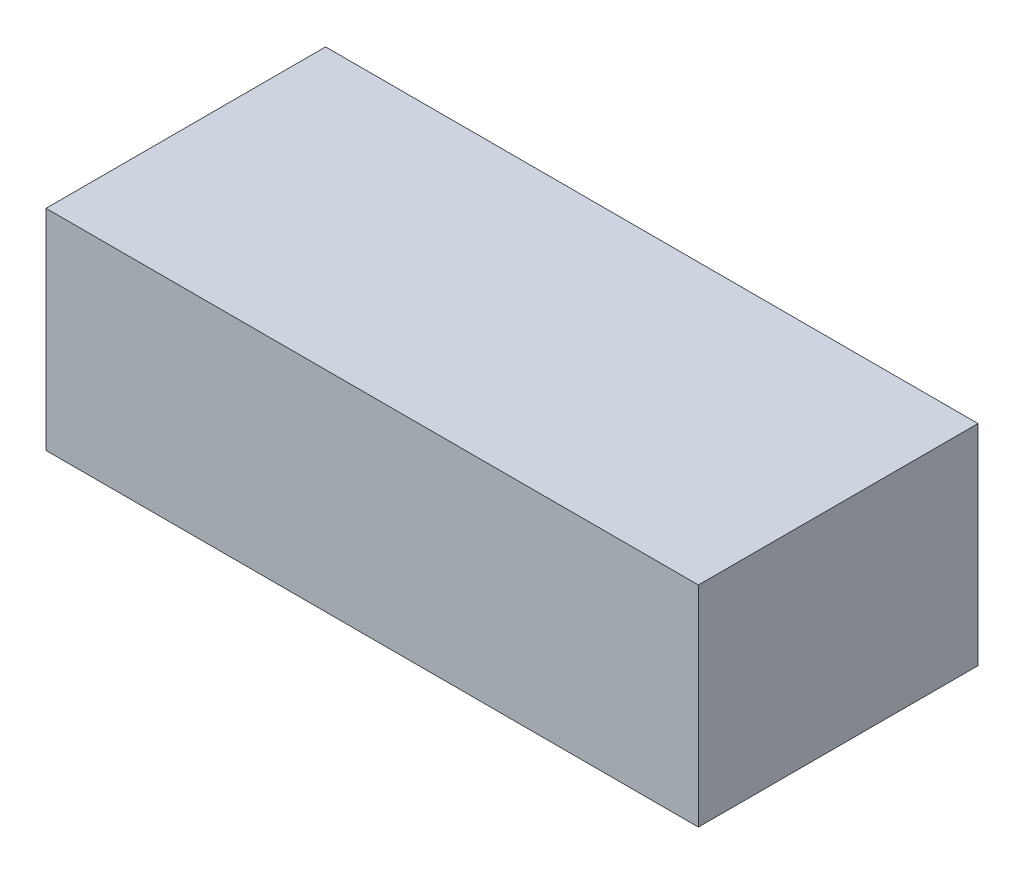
ISO-10303-21;
HEADER;
FILE_DESCRIPTION(('STEP AP214'),'2;1');
FILE_NAME('part.step','',(''),(''),'','','');
FILE_SCHEMA(('AUTOMOTIVE_DESIGN { 1 0 10303 214 1 1 1 1 }'));
ENDSEC;
DATA;
#1=APPLICATION_CONTEXT('core data for automotive mechanical design processes');
#2=APPLICATION_PROTOCOL_DEFINITION('international standard','automotive_design',2000,#1);
#3=PRODUCT_CONTEXT('',#1,'mechanical');
#4=PRODUCT('Part','Part','',(#3));
#5=PRODUCT_RELATED_PRODUCT_CATEGORY('part','',(#4));
#6=PRODUCT_DEFINITION_FORMATION('','',#4);
#7=PRODUCT_DEFINITION_CONTEXT('part definition',#1,'design');
#8=PRODUCT_DEFINITION('design','',#6,#7);
#9=PRODUCT_DEFINITION_SHAPE('','',#8);
#10=(LENGTH_UNIT() NAMED_UNIT(*) SI_UNIT(.MILLI.,.METRE.));
#11=(NAMED_UNIT(*) PLANE_ANGLE_UNIT() SI_UNIT($,.RADIAN.));
#12=(NAMED_UNIT(*) SI_UNIT($,.STERADIAN.) SOLID_ANGLE_UNIT());
#13=UNCERTAINTY_MEASURE_WITH_UNIT(LENGTH_MEASURE(1.E-05),#10,'distance_accuracy_value','');
#14=(GEOMETRIC_REPRESENTATION_CONTEXT(3) GLOBAL_UNCERTAINTY_ASSIGNED_CONTEXT((#13)) GLOBAL_UNIT_ASSIGNED_CONTEXT((#10,
#11,#12)) REPRESENTATION_CONTEXT('',''));
#15=CARTESIAN_POINT('',(0.,0.,0.));
#16=DIRECTION('',(0.,0.,1.));
#17=DIRECTION('',(1.,0.,0.));
#18=AXIS2_PLACEMENT_3D('',#15,#16,#17);
#19=CARTESIAN_POINT('',(-700.,-225.,-600.));
#20=DIRECTION('',(-1.,0.,0.));
#21=DIRECTION('',(0.,0.,1.));
#22=AXIS2_PLACEMENT_3D('',#19,#20,#21);
#23=PLANE('',#22);
#24=DIRECTION('',(0.,-1.,0.));
#25=VECTOR('',#24,1.);
#26=CARTESIAN_POINT('',(-700.,-225.,0.));
#27=LINE('',#26,#25);
#28=CARTESIAN_POINT('',(-700.,225.,0.));
#29=VERTEX_POINT('',#28);
#30=CARTESIAN_POINT('',(-700.,-225.,0.));
#31=VERTEX_POINT('',#30);
#32=EDGE_CURVE('E103',#29,#31,#27,.T.);
#33=ORIENTED_EDGE('',*,*,#32,.F.);
#34=DIRECTION('',(0.,0.,1.));
#35=VECTOR('',#34,1.);
#36=CARTESIAN_POINT('',(-700.,225.,-600.));
#37=LINE('',#36,#35);
#38=CARTESIAN_POINT('',(-700.,225.,-600.));
#39=VERTEX_POINT('',#38);
#40=EDGE_CURVE('E11',#39,#29,#37,.T.);
#41=ORIENTED_EDGE('',*,*,#40,.F.);
#42=DIRECTION('',(0.,-1.,0.));
#43=VECTOR('',#42,1.);
#44=CARTESIAN_POINT('',(-700.,-225.,-600.));
#45=LINE('',#44,#43);
#46=CARTESIAN_POINT('',(-700.,-225.,-600.));
#47=VERTEX_POINT('',#46);
#48=EDGE_CURVE('E100',#39,#47,#45,.T.);
#49=ORIENTED_EDGE('',*,*,#48,.T.);
#50=DIRECTION('',(0.,0.,1.));
#51=VECTOR('',#50,1.);
#52=CARTESIAN_POINT('',(-700.,-225.,-600.));
#53=LINE('',#52,#51);
#54=EDGE_CURVE('E45',#47,#31,#53,.T.);
#55=ORIENTED_EDGE('',*,*,#54,.T.);
#56=EDGE_LOOP('',(#33,#41,#49,#55));
#57=FACE_BOUND('',#56,.T.);
#58=ADVANCED_FACE('F39',(#57),#23,.T.);
#59=CARTESIAN_POINT('',(-700.,225.,-600.));
#60=DIRECTION('',(0.,1.,0.));
#61=DIRECTION('',(0.,0.,1.));
#62=AXIS2_PLACEMENT_3D('',#59,#60,#61);
#63=PLANE('',#62);
#64=DIRECTION('',(-1.,0.,0.));
#65=VECTOR('',#64,1.);
#66=CARTESIAN_POINT('',(-700.,225.,0.));
#67=LINE('',#66,#65);
#68=CARTESIAN_POINT('',(700.,225.,0.));
#69=VERTEX_POINT('',#68);
#70=EDGE_CURVE('E97',#69,#29,#67,.T.);
#71=ORIENTED_EDGE('',*,*,#70,.F.);
#72=DIRECTION('',(0.,0.,1.));
#73=VECTOR('',#72,1.);
#74=CARTESIAN_POINT('',(700.,225.,-600.));
#75=LINE('',#74,#73);
#76=CARTESIAN_POINT('',(700.,225.,-600.));
#77=VERTEX_POINT('',#76);
#78=EDGE_CURVE('E48',#77,#69,#75,.T.);
#79=ORIENTED_EDGE('',*,*,#78,.F.);
#80=DIRECTION('',(-1.,0.,0.));
#81=VECTOR('',#80,1.);
#82=CARTESIAN_POINT('',(-700.,225.,-600.));
#83=LINE('',#82,#81);
#84=EDGE_CURVE('E94',#77,#39,#83,.T.);
#85=ORIENTED_EDGE('',*,*,#84,.T.);
#86=ORIENTED_EDGE('',*,*,#40,.T.);
#87=EDGE_LOOP('',(#71,#79,#85,#86));
#88=FACE_BOUND('',#87,.T.);
#89=ADVANCED_FACE('F114',(#88),#63,.T.);
#90=CARTESIAN_POINT('',(700.,-225.,-600.));
#91=DIRECTION('',(1.,0.,0.));
#92=DIRECTION('',(0.,0.,-1.));
#93=AXIS2_PLACEMENT_3D('',#90,#91,#92);
#94=PLANE('',#93);
#95=DIRECTION('',(0.,1.,0.));
#96=VECTOR('',#95,1.);
#97=CARTESIAN_POINT('',(700.,-225.,0.));
#98=LINE('',#97,#96);
#99=CARTESIAN_POINT('',(700.,-225.,0.));
#100=VERTEX_POINT('',#99);
#101=EDGE_CURVE('E90',#100,#69,#98,.T.);
#102=ORIENTED_EDGE('',*,*,#101,.F.);
#103=DIRECTION('',(0.,0.,1.));
#104=VECTOR('',#103,1.);
#105=CARTESIAN_POINT('',(700.,-225.,-600.));
#106=LINE('',#105,#104);
#107=CARTESIAN_POINT('',(700.,-225.,-600.));
#108=VERTEX_POINT('',#107);
#109=EDGE_CURVE('E83',#108,#100,#106,.T.);
#110=ORIENTED_EDGE('',*,*,#109,.F.);
#111=DIRECTION('',(0.,1.,0.));
#112=VECTOR('',#111,1.);
#113=CARTESIAN_POINT('',(700.,-225.,-600.));
#114=LINE('',#113,#112);
#115=EDGE_CURVE('E87',#108,#77,#114,.T.);
#116=ORIENTED_EDGE('',*,*,#115,.T.);
#117=ORIENTED_EDGE('',*,*,#78,.T.);
#118=EDGE_LOOP('',(#102,#110,#116,#117));
#119=FACE_BOUND('',#118,.T.);
#120=ADVANCED_FACE('F88',(#119),#94,.T.);
#121=CARTESIAN_POINT('',(-700.,-225.,-600.));
#122=DIRECTION('',(0.,-1.,0.));
#123=DIRECTION('',(0.,0.,-1.));
#124=AXIS2_PLACEMENT_3D('',#121,#122,#123);
#125=PLANE('',#124);
#126=DIRECTION('',(1.,0.,0.));
#127=VECTOR('',#126,1.);
#128=CARTESIAN_POINT('',(-700.,-225.,0.));
#129=LINE('',#128,#127);
#130=EDGE_CURVE('E106',#31,#100,#129,.T.);
#131=ORIENTED_EDGE('',*,*,#130,.F.);
#132=ORIENTED_EDGE('',*,*,#54,.F.);
#133=DIRECTION('',(1.,0.,0.));
#134=VECTOR('',#133,1.);
#135=CARTESIAN_POINT('',(-700.,-225.,-600.));
#136=LINE('',#135,#134);
#137=EDGE_CURVE('E91',#47,#108,#136,.T.);
#138=ORIENTED_EDGE('',*,*,#137,.T.);
#139=ORIENTED_EDGE('',*,*,#109,.T.);
#140=EDGE_LOOP('',(#131,#132,#138,#139));
#141=FACE_BOUND('',#140,.T.);
#142=ADVANCED_FACE('F96',(#141),#125,.T.);
#143=CARTESIAN_POINT('',(0.,0.,-600.));
#144=DIRECTION('',(0.,0.,-1.));
#145=DIRECTION('',(-1.,0.,0.));
#146=AXIS2_PLACEMENT_3D('',#143,#144,#145);
#147=PLANE('',#146);
#148=ORIENTED_EDGE('',*,*,#48,.F.);
#149=ORIENTED_EDGE('',*,*,#84,.F.);
#150=ORIENTED_EDGE('',*,*,#115,.F.);
#151=ORIENTED_EDGE('',*,*,#137,.F.);
#152=EDGE_LOOP('',(#148,#149,#150,#151));
#153=FACE_BOUND('',#152,.T.);
#154=ADVANCED_FACE('F95',(#153),#147,.T.);
#155=CARTESIAN_POINT('',(0.,0.,0.));
#156=DIRECTION('',(0.,0.,-1.));
#157=DIRECTION('',(-1.,0.,0.));
#158=AXIS2_PLACEMENT_3D('',#155,#156,#157);
#159=PLANE('',#158);
#160=ORIENTED_EDGE('',*,*,#32,.T.);
#161=ORIENTED_EDGE('',*,*,#130,.T.);
#162=ORIENTED_EDGE('',*,*,#101,.T.);
#163=ORIENTED_EDGE('',*,*,#70,.T.);
#164=EDGE_LOOP('',(#160,#161,#162,#163));
#165=FACE_BOUND('',#164,.T.);
#166=ADVANCED_FACE('F115',(#165),#159,.F.);
#167=CLOSED_SHELL('',(#58,#89,#120,#142,#154,#166));
#168=MANIFOLD_SOLID_BREP('B2',#167);
#169=ADVANCED_BREP_SHAPE_REPRESENTATION('',(#18,#168),#14);
#170=SHAPE_DEFINITION_REPRESENTATION(#9,#169);
ENDSEC;
END-ISO-10303-21;
